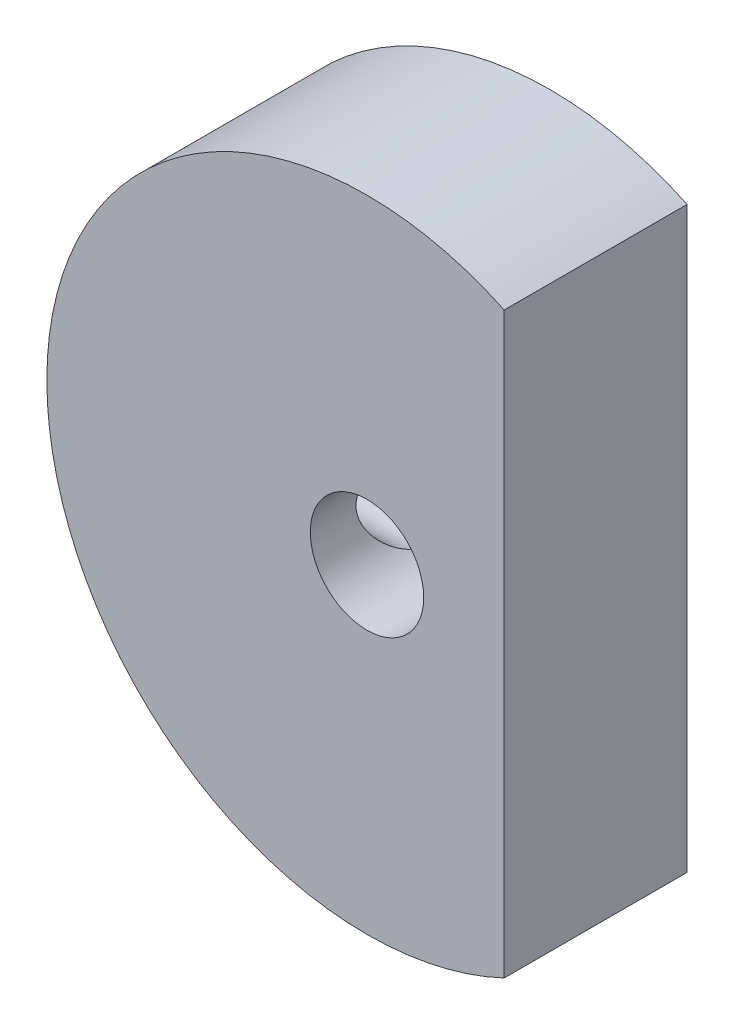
from build123d import *

# Parameters (mm, degrees)
ESQUISSE1_R               = 3.1
EXTRUSION1_DEPTH          = 5
TROU_TARAUD_M6X1_01_D     = 5
TROU_TARAUD_M6X1_01_DEPTH = 17.499
TROU_TARAUD_M6X1_01_TIP   = 1.502151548


with BuildPart() as part:
    # Esquisse1 → Extrusion1 (new, symmetric)
    with BuildSketch(Plane.XY):
        with BuildLine():
            Line((7.5, 15.811388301), (7.5, -15.811388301))
            ThreePointArc((7.5, -15.811388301), (-17.5, 0), (7.5, 15.811388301))
        make_face()
        Circle(ESQUISSE1_R, mode=Mode.SUBTRACT)
    extrude(amount=EXTRUSION1_DEPTH, both=True)

    # Trou taraud_ M6x1.01
    with Locations(Plane(origin=(-17.5, 0, 0), x_dir=(0, 0, -1), z_dir=(-1, 0, 0))):
        with Locations((0, 0)):
            Hole(TROU_TARAUD_M6X1_01_D / 2, depth=TROU_TARAUD_M6X1_01_DEPTH)
            with Locations((0, 0, -(TROU_TARAUD_M6X1_01_DEPTH + TROU_TARAUD_M6X1_01_TIP / 2))):  # 118° drill point
                Cone(0, TROU_TARAUD_M6X1_01_D / 2, TROU_TARAUD_M6X1_01_TIP, mode=Mode.SUBTRACT)


solid = part.part
